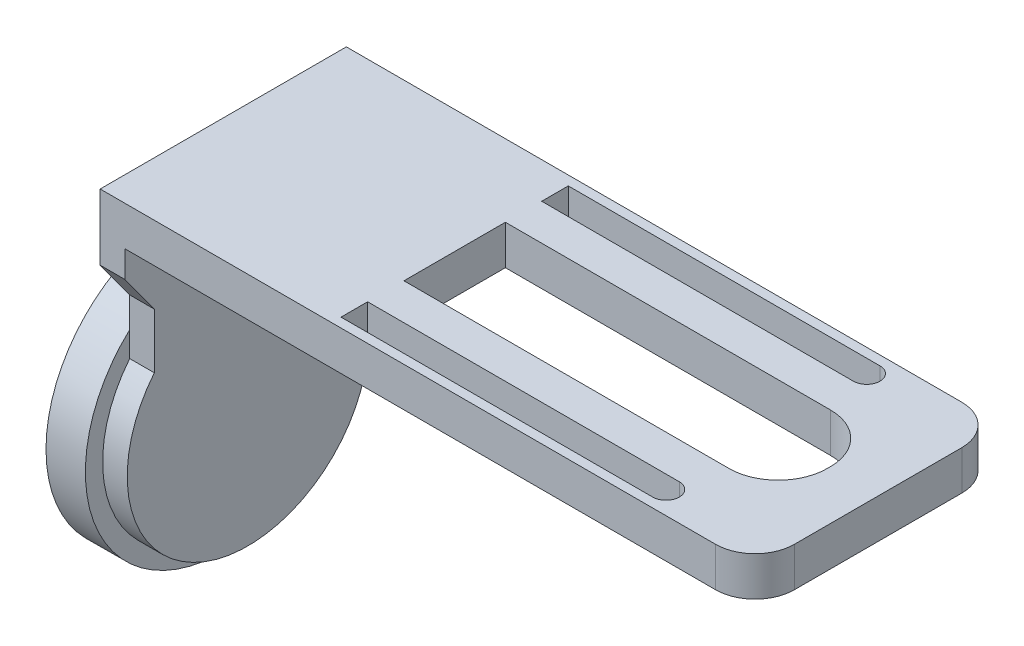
ISO-10303-21;
HEADER;
FILE_DESCRIPTION(('STEP AP214'),'2;1');
FILE_NAME('part.step','',(''),(''),'','','');
FILE_SCHEMA(('AUTOMOTIVE_DESIGN { 1 0 10303 214 1 1 1 1 }'));
ENDSEC;
DATA;
#1=APPLICATION_CONTEXT('core data for automotive mechanical design processes');
#2=APPLICATION_PROTOCOL_DEFINITION('international standard','automotive_design',2000,#1);
#3=PRODUCT_CONTEXT('',#1,'mechanical');
#4=PRODUCT('Part','Part','',(#3));
#5=PRODUCT_RELATED_PRODUCT_CATEGORY('part','',(#4));
#6=PRODUCT_DEFINITION_FORMATION('','',#4);
#7=PRODUCT_DEFINITION_CONTEXT('part definition',#1,'design');
#8=PRODUCT_DEFINITION('design','',#6,#7);
#9=PRODUCT_DEFINITION_SHAPE('','',#8);
#10=(LENGTH_UNIT() NAMED_UNIT(*) SI_UNIT(.MILLI.,.METRE.));
#11=(NAMED_UNIT(*) PLANE_ANGLE_UNIT() SI_UNIT($,.RADIAN.));
#12=(NAMED_UNIT(*) SI_UNIT($,.STERADIAN.) SOLID_ANGLE_UNIT());
#13=UNCERTAINTY_MEASURE_WITH_UNIT(LENGTH_MEASURE(1.E-05),#10,'distance_accuracy_value','');
#14=(GEOMETRIC_REPRESENTATION_CONTEXT(3) GLOBAL_UNCERTAINTY_ASSIGNED_CONTEXT((#13)) GLOBAL_UNIT_ASSIGNED_CONTEXT((#10,
#11,#12)) REPRESENTATION_CONTEXT('',''));
#15=CARTESIAN_POINT('',(0.,0.,0.));
#16=DIRECTION('',(0.,0.,1.));
#17=DIRECTION('',(1.,0.,0.));
#18=AXIS2_PLACEMENT_3D('',#15,#16,#17);
#19=CARTESIAN_POINT('',(62.5,4.,21.));
#20=DIRECTION('',(0.,1.,0.));
#21=DIRECTION('',(0.,0.,1.));
#22=AXIS2_PLACEMENT_3D('',#19,#20,#21);
#23=PLANE('',#22);
#24=DIRECTION('',(0.,0.,1.));
#25=VECTOR('',#24,1.);
#26=CARTESIAN_POINT('',(0.,4.,0.));
#27=LINE('',#26,#25);
#28=CARTESIAN_POINT('',(0.,4.,0.));
#29=VERTEX_POINT('',#28);
#30=CARTESIAN_POINT('',(0.,4.,25.));
#31=VERTEX_POINT('',#30);
#32=EDGE_CURVE('E441',#29,#31,#27,.T.);
#33=ORIENTED_EDGE('',*,*,#32,.T.);
#34=DIRECTION('',(1.,0.,0.));
#35=VECTOR('',#34,1.);
#36=CARTESIAN_POINT('',(0.,4.,25.));
#37=LINE('',#36,#35);
#38=CARTESIAN_POINT('',(62.5,4.,25.));
#39=VERTEX_POINT('',#38);
#40=EDGE_CURVE('E444',#31,#39,#37,.T.);
#41=ORIENTED_EDGE('',*,*,#40,.T.);
#42=CARTESIAN_POINT('',(62.5,4.,21.));
#43=DIRECTION('',(0.,1.,0.));
#44=DIRECTION('',(0.,0.,1.));
#45=AXIS2_PLACEMENT_3D('',#42,#43,#44);
#46=CIRCLE('',#45,4.);
#47=CARTESIAN_POINT('',(66.5,4.,21.));
#48=VERTEX_POINT('',#47);
#49=EDGE_CURVE('E447',#39,#48,#46,.T.);
#50=ORIENTED_EDGE('',*,*,#49,.T.);
#51=DIRECTION('',(0.,0.,-1.));
#52=VECTOR('',#51,1.);
#53=CARTESIAN_POINT('',(66.5,4.,4.00000000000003));
#54=LINE('',#53,#52);
#55=CARTESIAN_POINT('',(66.5,4.,4.00000000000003));
#56=VERTEX_POINT('',#55);
#57=EDGE_CURVE('E449',#48,#56,#54,.T.);
#58=ORIENTED_EDGE('',*,*,#57,.T.);
#59=CARTESIAN_POINT('',(62.5,4.,4.));
#60=DIRECTION('',(0.,1.,0.));
#61=DIRECTION('',(0.,0.,-1.));
#62=AXIS2_PLACEMENT_3D('',#59,#60,#61);
#63=CIRCLE('',#62,4.);
#64=CARTESIAN_POINT('',(62.5,4.,0.));
#65=VERTEX_POINT('',#64);
#66=EDGE_CURVE('E451',#56,#65,#63,.T.);
#67=ORIENTED_EDGE('',*,*,#66,.T.);
#68=DIRECTION('',(-1.,0.,0.));
#69=VECTOR('',#68,1.);
#70=CARTESIAN_POINT('',(0.,4.,0.));
#71=LINE('',#70,#69);
#72=EDGE_CURVE('E453',#65,#29,#71,.T.);
#73=ORIENTED_EDGE('',*,*,#72,.T.);
#74=EDGE_LOOP('',(#33,#41,#50,#58,#67,#73));
#75=FACE_BOUND('',#74,.T.);
#76=DIRECTION('',(1.,0.,0.));
#77=VECTOR('',#76,1.);
#78=CARTESIAN_POINT('',(23.5,4.,17.65));
#79=LINE('',#78,#77);
#80=CARTESIAN_POINT('',(23.5,4.,17.65));
#81=VERTEX_POINT('',#80);
#82=CARTESIAN_POINT('',(56.51,4.,17.65));
#83=VERTEX_POINT('',#82);
#84=EDGE_CURVE('E398',#81,#83,#79,.T.);
#85=ORIENTED_EDGE('',*,*,#84,.F.);
#86=DIRECTION('',(0.,0.,1.));
#87=VECTOR('',#86,1.);
#88=CARTESIAN_POINT('',(23.5,4.,7.35));
#89=LINE('',#88,#87);
#90=CARTESIAN_POINT('',(23.5,4.,7.35));
#91=VERTEX_POINT('',#90);
#92=EDGE_CURVE('E396',#91,#81,#89,.T.);
#93=ORIENTED_EDGE('',*,*,#92,.F.);
#94=DIRECTION('',(-1.,0.,0.));
#95=VECTOR('',#94,1.);
#96=CARTESIAN_POINT('',(23.5,4.,7.35));
#97=LINE('',#96,#95);
#98=CARTESIAN_POINT('',(56.51,4.,7.35));
#99=VERTEX_POINT('',#98);
#100=EDGE_CURVE('E408',#99,#91,#97,.T.);
#101=ORIENTED_EDGE('',*,*,#100,.F.);
#102=CARTESIAN_POINT('',(56.51,4.,12.34));
#103=DIRECTION('',(0.,1.,0.));
#104=DIRECTION('',(0.,0.,-1.));
#105=AXIS2_PLACEMENT_3D('',#102,#103,#104);
#106=CIRCLE('',#105,4.99);
#107=CARTESIAN_POINT('',(61.5,4.,12.34));
#108=VERTEX_POINT('',#107);
#109=EDGE_CURVE('E405',#108,#99,#106,.T.);
#110=ORIENTED_EDGE('',*,*,#109,.F.);
#111=DIRECTION('',(0.,0.,-1.));
#112=VECTOR('',#111,1.);
#113=CARTESIAN_POINT('',(61.5,4.,12.34));
#114=LINE('',#113,#112);
#115=CARTESIAN_POINT('',(61.5,4.,12.66));
#116=VERTEX_POINT('',#115);
#117=EDGE_CURVE('E403',#116,#108,#114,.T.);
#118=ORIENTED_EDGE('',*,*,#117,.F.);
#119=CARTESIAN_POINT('',(56.51,4.,12.66));
#120=DIRECTION('',(0.,1.,0.));
#121=DIRECTION('',(0.,0.,1.));
#122=AXIS2_PLACEMENT_3D('',#119,#120,#121);
#123=CIRCLE('',#122,4.99);
#124=EDGE_CURVE('E401',#83,#116,#123,.T.);
#125=ORIENTED_EDGE('',*,*,#124,.F.);
#126=EDGE_LOOP('',(#85,#93,#101,#110,#118,#125));
#127=FACE_BOUND('',#126,.T.);
#128=DIRECTION('',(1.,0.,0.));
#129=VECTOR('',#128,1.);
#130=CARTESIAN_POINT('',(23.5,4.,3.66));
#131=LINE('',#130,#129);
#132=CARTESIAN_POINT('',(23.5,4.,3.66));
#133=VERTEX_POINT('',#132);
#134=CARTESIAN_POINT('',(55.151,4.,3.66));
#135=VERTEX_POINT('',#134);
#136=EDGE_CURVE('E353',#133,#135,#131,.T.);
#137=ORIENTED_EDGE('',*,*,#136,.F.);
#138=DIRECTION('',(0.,0.,1.));
#139=VECTOR('',#138,1.);
#140=CARTESIAN_POINT('',(23.5,4.,0.960000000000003));
#141=LINE('',#140,#139);
#142=CARTESIAN_POINT('',(23.5,4.,0.960000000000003));
#143=VERTEX_POINT('',#142);
#144=EDGE_CURVE('E351',#143,#133,#141,.T.);
#145=ORIENTED_EDGE('',*,*,#144,.F.);
#146=DIRECTION('',(-1.,0.,0.));
#147=VECTOR('',#146,1.);
#148=CARTESIAN_POINT('',(23.5,4.,0.960000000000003));
#149=LINE('',#148,#147);
#150=CARTESIAN_POINT('',(55.151,4.,0.96));
#151=VERTEX_POINT('',#150);
#152=EDGE_CURVE('E363',#151,#143,#149,.T.);
#153=ORIENTED_EDGE('',*,*,#152,.F.);
#154=CARTESIAN_POINT('',(55.151,4.,2.309));
#155=DIRECTION('',(0.,1.,0.));
#156=DIRECTION('',(0.,0.,-1.));
#157=AXIS2_PLACEMENT_3D('',#154,#155,#156);
#158=CIRCLE('',#157,1.349);
#159=CARTESIAN_POINT('',(56.5,4.,2.309));
#160=VERTEX_POINT('',#159);
#161=EDGE_CURVE('E360',#160,#151,#158,.T.);
#162=ORIENTED_EDGE('',*,*,#161,.F.);
#163=DIRECTION('',(0.,0.,-1.));
#164=VECTOR('',#163,1.);
#165=CARTESIAN_POINT('',(56.5,4.,2.309));
#166=LINE('',#165,#164);
#167=CARTESIAN_POINT('',(56.5,4.,2.311));
#168=VERTEX_POINT('',#167);
#169=EDGE_CURVE('E358',#168,#160,#166,.T.);
#170=ORIENTED_EDGE('',*,*,#169,.F.);
#171=CARTESIAN_POINT('',(55.151,4.,2.311));
#172=DIRECTION('',(0.,1.,0.));
#173=DIRECTION('',(0.,0.,1.));
#174=AXIS2_PLACEMENT_3D('',#171,#172,#173);
#175=CIRCLE('',#174,1.349);
#176=EDGE_CURVE('E356',#135,#168,#175,.T.);
#177=ORIENTED_EDGE('',*,*,#176,.F.);
#178=EDGE_LOOP('',(#137,#145,#153,#162,#170,#177));
#179=FACE_BOUND('',#178,.T.);
#180=DIRECTION('',(1.,0.,0.));
#181=VECTOR('',#180,1.);
#182=CARTESIAN_POINT('',(23.5,4.,24.04));
#183=LINE('',#182,#181);
#184=CARTESIAN_POINT('',(23.5,4.,24.04));
#185=VERTEX_POINT('',#184);
#186=CARTESIAN_POINT('',(55.151,4.,24.04));
#187=VERTEX_POINT('',#186);
#188=EDGE_CURVE('E308',#185,#187,#183,.T.);
#189=ORIENTED_EDGE('',*,*,#188,.F.);
#190=DIRECTION('',(0.,0.,1.));
#191=VECTOR('',#190,1.);
#192=CARTESIAN_POINT('',(23.5,4.,24.04));
#193=LINE('',#192,#191);
#194=CARTESIAN_POINT('',(23.5,4.,21.34));
#195=VERTEX_POINT('',#194);
#196=EDGE_CURVE('E306',#195,#185,#193,.T.);
#197=ORIENTED_EDGE('',*,*,#196,.F.);
#198=DIRECTION('',(-1.,0.,0.));
#199=VECTOR('',#198,1.);
#200=CARTESIAN_POINT('',(23.5,4.,21.34));
#201=LINE('',#200,#199);
#202=CARTESIAN_POINT('',(55.151,4.,21.34));
#203=VERTEX_POINT('',#202);
#204=EDGE_CURVE('E318',#203,#195,#201,.T.);
#205=ORIENTED_EDGE('',*,*,#204,.F.);
#206=CARTESIAN_POINT('',(55.151,4.,22.689));
#207=DIRECTION('',(0.,1.,0.));
#208=DIRECTION('',(0.,0.,-1.));
#209=AXIS2_PLACEMENT_3D('',#206,#207,#208);
#210=CIRCLE('',#209,1.34900000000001);
#211=CARTESIAN_POINT('',(56.5,4.,22.689));
#212=VERTEX_POINT('',#211);
#213=EDGE_CURVE('E315',#212,#203,#210,.T.);
#214=ORIENTED_EDGE('',*,*,#213,.F.);
#215=DIRECTION('',(0.,0.,-1.));
#216=VECTOR('',#215,1.);
#217=CARTESIAN_POINT('',(56.5,4.,22.691));
#218=LINE('',#217,#216);
#219=CARTESIAN_POINT('',(56.5,4.,22.691));
#220=VERTEX_POINT('',#219);
#221=EDGE_CURVE('E313',#220,#212,#218,.T.);
#222=ORIENTED_EDGE('',*,*,#221,.F.);
#223=CARTESIAN_POINT('',(55.151,4.,22.691));
#224=DIRECTION('',(0.,1.,0.));
#225=DIRECTION('',(0.,0.,-1.));
#226=AXIS2_PLACEMENT_3D('',#223,#224,#225);
#227=CIRCLE('',#226,1.349);
#228=EDGE_CURVE('E311',#187,#220,#227,.T.);
#229=ORIENTED_EDGE('',*,*,#228,.F.);
#230=EDGE_LOOP('',(#189,#197,#205,#214,#222,#229));
#231=FACE_BOUND('',#230,.T.);
#232=ADVANCED_FACE('F33',(#75,#127,#179,#231),#23,.T.);
#233=CARTESIAN_POINT('',(62.5,0.,21.));
#234=DIRECTION('',(0.,1.,0.));
#235=DIRECTION('',(0.,0.,1.));
#236=AXIS2_PLACEMENT_3D('',#233,#234,#235);
#237=PLANE('',#236);
#238=DIRECTION('',(0.,0.,1.));
#239=VECTOR('',#238,1.);
#240=CARTESIAN_POINT('',(23.5,0.,0.960000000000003));
#241=LINE('',#240,#239);
#242=CARTESIAN_POINT('',(23.5,0.,0.960000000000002));
#243=VERTEX_POINT('',#242);
#244=CARTESIAN_POINT('',(23.5,0.,3.66));
#245=VERTEX_POINT('',#244);
#246=EDGE_CURVE('E350',#243,#245,#241,.T.);
#247=ORIENTED_EDGE('',*,*,#246,.T.);
#248=DIRECTION('',(1.,0.,0.));
#249=VECTOR('',#248,1.);
#250=CARTESIAN_POINT('',(23.5,0.,3.66));
#251=LINE('',#250,#249);
#252=CARTESIAN_POINT('',(55.151,0.,3.66));
#253=VERTEX_POINT('',#252);
#254=EDGE_CURVE('E368',#245,#253,#251,.T.);
#255=ORIENTED_EDGE('',*,*,#254,.T.);
#256=CARTESIAN_POINT('',(55.151,0.,2.311));
#257=DIRECTION('',(0.,1.,0.));
#258=DIRECTION('',(0.,0.,1.));
#259=AXIS2_PLACEMENT_3D('',#256,#257,#258);
#260=CIRCLE('',#259,1.349);
#261=CARTESIAN_POINT('',(56.5,0.,2.311));
#262=VERTEX_POINT('',#261);
#263=EDGE_CURVE('E371',#253,#262,#260,.T.);
#264=ORIENTED_EDGE('',*,*,#263,.T.);
#265=DIRECTION('',(0.,0.,-1.));
#266=VECTOR('',#265,1.);
#267=CARTESIAN_POINT('',(56.5,0.,2.309));
#268=LINE('',#267,#266);
#269=CARTESIAN_POINT('',(56.5,0.,2.309));
#270=VERTEX_POINT('',#269);
#271=EDGE_CURVE('E374',#262,#270,#268,.T.);
#272=ORIENTED_EDGE('',*,*,#271,.T.);
#273=CARTESIAN_POINT('',(55.151,0.,2.309));
#274=DIRECTION('',(0.,1.,0.));
#275=DIRECTION('',(0.,0.,-1.));
#276=AXIS2_PLACEMENT_3D('',#273,#274,#275);
#277=CIRCLE('',#276,1.349);
#278=CARTESIAN_POINT('',(55.151,0.,0.96));
#279=VERTEX_POINT('',#278);
#280=EDGE_CURVE('E377',#270,#279,#277,.T.);
#281=ORIENTED_EDGE('',*,*,#280,.T.);
#282=DIRECTION('',(-1.,0.,0.));
#283=VECTOR('',#282,1.);
#284=CARTESIAN_POINT('',(23.5,0.,0.960000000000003));
#285=LINE('',#284,#283);
#286=EDGE_CURVE('E354',#279,#243,#285,.T.);
#287=ORIENTED_EDGE('',*,*,#286,.T.);
#288=EDGE_LOOP('',(#247,#255,#264,#272,#281,#287));
#289=FACE_BOUND('',#288,.T.);
#290=DIRECTION('',(1.,0.,0.));
#291=VECTOR('',#290,1.);
#292=CARTESIAN_POINT('',(0.,0.,25.));
#293=LINE('',#292,#291);
#294=CARTESIAN_POINT('',(2.5,0.,25.));
#295=VERTEX_POINT('',#294);
#296=CARTESIAN_POINT('',(62.5,0.,25.));
#297=VERTEX_POINT('',#296);
#298=EDGE_CURVE('E440',#295,#297,#293,.T.);
#299=ORIENTED_EDGE('',*,*,#298,.F.);
#300=DIRECTION('',(0.,0.,-1.));
#301=VECTOR('',#300,1.);
#302=CARTESIAN_POINT('',(2.5,0.,25.));
#303=LINE('',#302,#301);
#304=CARTESIAN_POINT('',(2.5,0.,0.));
#305=VERTEX_POINT('',#304);
#306=EDGE_CURVE('E267',#295,#305,#303,.T.);
#307=ORIENTED_EDGE('',*,*,#306,.T.);
#308=DIRECTION('',(-1.,0.,0.));
#309=VECTOR('',#308,1.);
#310=CARTESIAN_POINT('',(0.,0.,0.));
#311=LINE('',#310,#309);
#312=CARTESIAN_POINT('',(62.5,0.,0.));
#313=VERTEX_POINT('',#312);
#314=EDGE_CURVE('E445',#313,#305,#311,.T.);
#315=ORIENTED_EDGE('',*,*,#314,.F.);
#316=CARTESIAN_POINT('',(62.5,0.,4.));
#317=DIRECTION('',(0.,1.,0.));
#318=DIRECTION('',(0.,0.,-1.));
#319=AXIS2_PLACEMENT_3D('',#316,#317,#318);
#320=CIRCLE('',#319,4.);
#321=CARTESIAN_POINT('',(66.5,0.,4.00000000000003));
#322=VERTEX_POINT('',#321);
#323=EDGE_CURVE('E461',#322,#313,#320,.T.);
#324=ORIENTED_EDGE('',*,*,#323,.F.);
#325=DIRECTION('',(0.,0.,-1.));
#326=VECTOR('',#325,1.);
#327=CARTESIAN_POINT('',(66.5,0.,4.00000000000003));
#328=LINE('',#327,#326);
#329=CARTESIAN_POINT('',(66.5,0.,21.));
#330=VERTEX_POINT('',#329);
#331=EDGE_CURVE('E459',#330,#322,#328,.T.);
#332=ORIENTED_EDGE('',*,*,#331,.F.);
#333=CARTESIAN_POINT('',(62.5,0.,21.));
#334=DIRECTION('',(0.,1.,0.));
#335=DIRECTION('',(0.,0.,1.));
#336=AXIS2_PLACEMENT_3D('',#333,#334,#335);
#337=CIRCLE('',#336,4.);
#338=EDGE_CURVE('E457',#297,#330,#337,.T.);
#339=ORIENTED_EDGE('',*,*,#338,.F.);
#340=EDGE_LOOP('',(#299,#307,#315,#324,#332,#339));
#341=FACE_BOUND('',#340,.T.);
#342=DIRECTION('',(0.,0.,1.));
#343=VECTOR('',#342,1.);
#344=CARTESIAN_POINT('',(23.5,0.,7.35));
#345=LINE('',#344,#343);
#346=CARTESIAN_POINT('',(23.5,0.,7.35));
#347=VERTEX_POINT('',#346);
#348=CARTESIAN_POINT('',(23.5,0.,17.65));
#349=VERTEX_POINT('',#348);
#350=EDGE_CURVE('E395',#347,#349,#345,.T.);
#351=ORIENTED_EDGE('',*,*,#350,.T.);
#352=DIRECTION('',(1.,0.,0.));
#353=VECTOR('',#352,1.);
#354=CARTESIAN_POINT('',(23.5,0.,17.65));
#355=LINE('',#354,#353);
#356=CARTESIAN_POINT('',(56.51,0.,17.65));
#357=VERTEX_POINT('',#356);
#358=EDGE_CURVE('E413',#349,#357,#355,.T.);
#359=ORIENTED_EDGE('',*,*,#358,.T.);
#360=CARTESIAN_POINT('',(56.51,0.,12.66));
#361=DIRECTION('',(0.,1.,0.));
#362=DIRECTION('',(0.,0.,1.));
#363=AXIS2_PLACEMENT_3D('',#360,#361,#362);
#364=CIRCLE('',#363,4.99);
#365=CARTESIAN_POINT('',(61.5,0.,12.66));
#366=VERTEX_POINT('',#365);
#367=EDGE_CURVE('E416',#357,#366,#364,.T.);
#368=ORIENTED_EDGE('',*,*,#367,.T.);
#369=DIRECTION('',(0.,0.,-1.));
#370=VECTOR('',#369,1.);
#371=CARTESIAN_POINT('',(61.5,0.,12.34));
#372=LINE('',#371,#370);
#373=CARTESIAN_POINT('',(61.5,0.,12.34));
#374=VERTEX_POINT('',#373);
#375=EDGE_CURVE('E419',#366,#374,#372,.T.);
#376=ORIENTED_EDGE('',*,*,#375,.T.);
#377=CARTESIAN_POINT('',(56.51,0.,12.34));
#378=DIRECTION('',(0.,1.,0.));
#379=DIRECTION('',(0.,0.,-1.));
#380=AXIS2_PLACEMENT_3D('',#377,#378,#379);
#381=CIRCLE('',#380,4.99);
#382=CARTESIAN_POINT('',(56.51,0.,7.35));
#383=VERTEX_POINT('',#382);
#384=EDGE_CURVE('E422',#374,#383,#381,.T.);
#385=ORIENTED_EDGE('',*,*,#384,.T.);
#386=DIRECTION('',(-1.,0.,0.));
#387=VECTOR('',#386,1.);
#388=CARTESIAN_POINT('',(23.5,0.,7.35));
#389=LINE('',#388,#387);
#390=EDGE_CURVE('E399',#383,#347,#389,.T.);
#391=ORIENTED_EDGE('',*,*,#390,.T.);
#392=EDGE_LOOP('',(#351,#359,#368,#376,#385,#391));
#393=FACE_BOUND('',#392,.T.);
#394=DIRECTION('',(0.,0.,1.));
#395=VECTOR('',#394,1.);
#396=CARTESIAN_POINT('',(23.5,0.,24.04));
#397=LINE('',#396,#395);
#398=CARTESIAN_POINT('',(23.5,0.,21.34));
#399=VERTEX_POINT('',#398);
#400=CARTESIAN_POINT('',(23.5,0.,24.04));
#401=VERTEX_POINT('',#400);
#402=EDGE_CURVE('E295',#399,#401,#397,.T.);
#403=ORIENTED_EDGE('',*,*,#402,.T.);
#404=DIRECTION('',(1.,0.,0.));
#405=VECTOR('',#404,1.);
#406=CARTESIAN_POINT('',(23.5,0.,24.04));
#407=LINE('',#406,#405);
#408=CARTESIAN_POINT('',(55.151,0.,24.04));
#409=VERTEX_POINT('',#408);
#410=EDGE_CURVE('E323',#401,#409,#407,.T.);
#411=ORIENTED_EDGE('',*,*,#410,.T.);
#412=CARTESIAN_POINT('',(55.151,0.,22.691));
#413=DIRECTION('',(0.,1.,0.));
#414=DIRECTION('',(0.,0.,-1.));
#415=AXIS2_PLACEMENT_3D('',#412,#413,#414);
#416=CIRCLE('',#415,1.349);
#417=CARTESIAN_POINT('',(56.5,0.,22.691));
#418=VERTEX_POINT('',#417);
#419=EDGE_CURVE('E326',#409,#418,#416,.T.);
#420=ORIENTED_EDGE('',*,*,#419,.T.);
#421=DIRECTION('',(0.,0.,-1.));
#422=VECTOR('',#421,1.);
#423=CARTESIAN_POINT('',(56.5,0.,22.691));
#424=LINE('',#423,#422);
#425=CARTESIAN_POINT('',(56.5,0.,22.689));
#426=VERTEX_POINT('',#425);
#427=EDGE_CURVE('E329',#418,#426,#424,.T.);
#428=ORIENTED_EDGE('',*,*,#427,.T.);
#429=CARTESIAN_POINT('',(55.151,0.,22.689));
#430=DIRECTION('',(0.,1.,0.));
#431=DIRECTION('',(0.,0.,-1.));
#432=AXIS2_PLACEMENT_3D('',#429,#430,#431);
#433=CIRCLE('',#432,1.34900000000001);
#434=CARTESIAN_POINT('',(55.151,0.,21.34));
#435=VERTEX_POINT('',#434);
#436=EDGE_CURVE('E332',#426,#435,#433,.T.);
#437=ORIENTED_EDGE('',*,*,#436,.T.);
#438=DIRECTION('',(-1.,0.,0.));
#439=VECTOR('',#438,1.);
#440=CARTESIAN_POINT('',(23.5,0.,21.34));
#441=LINE('',#440,#439);
#442=EDGE_CURVE('E309',#435,#399,#441,.T.);
#443=ORIENTED_EDGE('',*,*,#442,.T.);
#444=EDGE_LOOP('',(#403,#411,#420,#428,#437,#443));
#445=FACE_BOUND('',#444,.T.);
#446=ADVANCED_FACE('F485',(#289,#341,#393,#445),#237,.F.);
#447=CARTESIAN_POINT('',(0.,4.,0.));
#448=DIRECTION('',(1.,0.,0.));
#449=DIRECTION('',(0.,0.,-1.));
#450=AXIS2_PLACEMENT_3D('',#447,#448,#449);
#451=PLANE('',#450);
#452=CARTESIAN_POINT('',(0.,-20.15,12.5));
#453=DIRECTION('',(-1.,0.,0.));
#454=DIRECTION('',(0.,0.,1.));
#455=AXIS2_PLACEMENT_3D('',#452,#453,#454);
#456=CIRCLE('',#455,14.);
#457=CARTESIAN_POINT('',(0.,-9.86651809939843,22.));
#458=VERTEX_POINT('',#457);
#459=CARTESIAN_POINT('',(0.,-9.86651809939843,3.));
#460=VERTEX_POINT('',#459);
#461=EDGE_CURVE('E48',#458,#460,#456,.T.);
#462=ORIENTED_EDGE('',*,*,#461,.F.);
#463=DIRECTION('',(0.,1.,0.));
#464=VECTOR('',#463,1.);
#465=CARTESIAN_POINT('',(0.,-6.81614585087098,22.));
#466=LINE('',#465,#464);
#467=CARTESIAN_POINT('',(0.,-6.81614585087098,22.));
#468=VERTEX_POINT('',#467);
#469=EDGE_CURVE('E288',#458,#468,#466,.T.);
#470=ORIENTED_EDGE('',*,*,#469,.T.);
#471=DIRECTION('',(0.,0.808134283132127,0.58899828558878));
#472=VECTOR('',#471,1.);
#473=CARTESIAN_POINT('',(0.,-2.7,25.));
#474=LINE('',#473,#472);
#475=CARTESIAN_POINT('',(0.,-2.7,25.));
#476=VERTEX_POINT('',#475);
#477=EDGE_CURVE('E268',#468,#476,#474,.T.);
#478=ORIENTED_EDGE('',*,*,#477,.T.);
#479=DIRECTION('',(0.,-1.,0.));
#480=VECTOR('',#479,1.);
#481=CARTESIAN_POINT('',(0.,4.,25.));
#482=LINE('',#481,#480);
#483=EDGE_CURVE('E11',#31,#476,#482,.T.);
#484=ORIENTED_EDGE('',*,*,#483,.F.);
#485=ORIENTED_EDGE('',*,*,#32,.F.);
#486=DIRECTION('',(0.,-1.,0.));
#487=VECTOR('',#486,1.);
#488=CARTESIAN_POINT('',(0.,4.,0.));
#489=LINE('',#488,#487);
#490=CARTESIAN_POINT('',(0.,-2.7,0.));
#491=VERTEX_POINT('',#490);
#492=EDGE_CURVE('E455',#29,#491,#489,.T.);
#493=ORIENTED_EDGE('',*,*,#492,.T.);
#494=DIRECTION('',(0.,-0.808134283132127,0.588998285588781));
#495=VECTOR('',#494,1.);
#496=CARTESIAN_POINT('',(0.,-2.7,0.));
#497=LINE('',#496,#495);
#498=CARTESIAN_POINT('',(0.,-6.81614585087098,3.));
#499=VERTEX_POINT('',#498);
#500=EDGE_CURVE('E238',#491,#499,#497,.T.);
#501=ORIENTED_EDGE('',*,*,#500,.T.);
#502=DIRECTION('',(0.,-1.,0.));
#503=VECTOR('',#502,1.);
#504=CARTESIAN_POINT('',(0.,-6.81614585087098,3.));
#505=LINE('',#504,#503);
#506=EDGE_CURVE('E235',#499,#460,#505,.T.);
#507=ORIENTED_EDGE('',*,*,#506,.T.);
#508=EDGE_LOOP('',(#462,#470,#478,#484,#485,#493,#501,#507));
#509=FACE_BOUND('',#508,.T.);
#510=ADVANCED_FACE('F35',(#509),#451,.F.);
#511=CARTESIAN_POINT('',(0.,4.,25.));
#512=DIRECTION('',(0.,0.,-1.));
#513=DIRECTION('',(-1.,0.,0.));
#514=AXIS2_PLACEMENT_3D('',#511,#512,#513);
#515=PLANE('',#514);
#516=ORIENTED_EDGE('',*,*,#483,.T.);
#517=DIRECTION('',(-1.,0.,0.));
#518=VECTOR('',#517,1.);
#519=CARTESIAN_POINT('',(2.5,-2.7,25.));
#520=LINE('',#519,#518);
#521=CARTESIAN_POINT('',(2.5,-2.7,25.));
#522=VERTEX_POINT('',#521);
#523=EDGE_CURVE('E292',#522,#476,#520,.T.);
#524=ORIENTED_EDGE('',*,*,#523,.F.);
#525=DIRECTION('',(0.,1.,0.));
#526=VECTOR('',#525,1.);
#527=CARTESIAN_POINT('',(2.5,0.,25.));
#528=LINE('',#527,#526);
#529=EDGE_CURVE('E264',#522,#295,#528,.T.);
#530=ORIENTED_EDGE('',*,*,#529,.T.);
#531=ORIENTED_EDGE('',*,*,#298,.T.);
#532=DIRECTION('',(0.,-1.,0.));
#533=VECTOR('',#532,1.);
#534=CARTESIAN_POINT('',(62.5,4.,25.));
#535=LINE('',#534,#533);
#536=EDGE_CURVE('E41',#39,#297,#535,.T.);
#537=ORIENTED_EDGE('',*,*,#536,.F.);
#538=ORIENTED_EDGE('',*,*,#40,.F.);
#539=EDGE_LOOP('',(#516,#524,#530,#531,#537,#538));
#540=FACE_BOUND('',#539,.T.);
#541=ADVANCED_FACE('F503',(#540),#515,.F.);
#542=CARTESIAN_POINT('',(62.5,4.,21.));
#543=DIRECTION('',(0.,-1.,0.));
#544=DIRECTION('',(0.,0.,-1.));
#545=AXIS2_PLACEMENT_3D('',#542,#543,#544);
#546=CYLINDRICAL_SURFACE('',#545,4.);
#547=ORIENTED_EDGE('',*,*,#338,.T.);
#548=DIRECTION('',(0.,-1.,0.));
#549=VECTOR('',#548,1.);
#550=CARTESIAN_POINT('',(66.5,4.,21.));
#551=LINE('',#550,#549);
#552=EDGE_CURVE('E472',#48,#330,#551,.T.);
#553=ORIENTED_EDGE('',*,*,#552,.F.);
#554=ORIENTED_EDGE('',*,*,#49,.F.);
#555=ORIENTED_EDGE('',*,*,#536,.T.);
#556=EDGE_LOOP('',(#547,#553,#554,#555));
#557=FACE_BOUND('',#556,.T.);
#558=ADVANCED_FACE('F479',(#557),#546,.T.);
#559=CARTESIAN_POINT('',(66.5,4.,4.00000000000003));
#560=DIRECTION('',(-1.,0.,0.));
#561=DIRECTION('',(0.,0.,1.));
#562=AXIS2_PLACEMENT_3D('',#559,#560,#561);
#563=PLANE('',#562);
#564=ORIENTED_EDGE('',*,*,#331,.T.);
#565=DIRECTION('',(0.,-1.,0.));
#566=VECTOR('',#565,1.);
#567=CARTESIAN_POINT('',(66.5,4.,4.00000000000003));
#568=LINE('',#567,#566);
#569=EDGE_CURVE('E469',#56,#322,#568,.T.);
#570=ORIENTED_EDGE('',*,*,#569,.F.);
#571=ORIENTED_EDGE('',*,*,#57,.F.);
#572=ORIENTED_EDGE('',*,*,#552,.T.);
#573=EDGE_LOOP('',(#564,#570,#571,#572));
#574=FACE_BOUND('',#573,.T.);
#575=ADVANCED_FACE('F491',(#574),#563,.F.);
#576=CARTESIAN_POINT('',(62.5,4.,4.));
#577=DIRECTION('',(0.,-1.,0.));
#578=DIRECTION('',(0.,0.,-1.));
#579=AXIS2_PLACEMENT_3D('',#576,#577,#578);
#580=CYLINDRICAL_SURFACE('',#579,4.);
#581=ORIENTED_EDGE('',*,*,#323,.T.);
#582=DIRECTION('',(0.,-1.,0.));
#583=VECTOR('',#582,1.);
#584=CARTESIAN_POINT('',(62.5,4.,0.));
#585=LINE('',#584,#583);
#586=EDGE_CURVE('E466',#65,#313,#585,.T.);
#587=ORIENTED_EDGE('',*,*,#586,.F.);
#588=ORIENTED_EDGE('',*,*,#66,.F.);
#589=ORIENTED_EDGE('',*,*,#569,.T.);
#590=EDGE_LOOP('',(#581,#587,#588,#589));
#591=FACE_BOUND('',#590,.T.);
#592=ADVANCED_FACE('F495',(#591),#580,.T.);
#593=CARTESIAN_POINT('',(0.,4.,0.));
#594=DIRECTION('',(0.,0.,1.));
#595=DIRECTION('',(1.,0.,0.));
#596=AXIS2_PLACEMENT_3D('',#593,#594,#595);
#597=PLANE('',#596);
#598=ORIENTED_EDGE('',*,*,#314,.T.);
#599=DIRECTION('',(0.,-1.,0.));
#600=VECTOR('',#599,1.);
#601=CARTESIAN_POINT('',(2.5,0.,0.));
#602=LINE('',#601,#600);
#603=CARTESIAN_POINT('',(2.5,-2.7,0.));
#604=VERTEX_POINT('',#603);
#605=EDGE_CURVE('E56',#305,#604,#602,.T.);
#606=ORIENTED_EDGE('',*,*,#605,.T.);
#607=DIRECTION('',(-1.,0.,0.));
#608=VECTOR('',#607,1.);
#609=CARTESIAN_POINT('',(2.5,-2.7,0.));
#610=LINE('',#609,#608);
#611=EDGE_CURVE('E285',#604,#491,#610,.T.);
#612=ORIENTED_EDGE('',*,*,#611,.T.);
#613=ORIENTED_EDGE('',*,*,#492,.F.);
#614=ORIENTED_EDGE('',*,*,#72,.F.);
#615=ORIENTED_EDGE('',*,*,#586,.T.);
#616=EDGE_LOOP('',(#598,#606,#612,#613,#614,#615));
#617=FACE_BOUND('',#616,.T.);
#618=ADVANCED_FACE('F515',(#617),#597,.F.);
#619=CARTESIAN_POINT('',(23.5,4.,7.35));
#620=DIRECTION('',(1.,0.,0.));
#621=DIRECTION('',(0.,0.,-1.));
#622=AXIS2_PLACEMENT_3D('',#619,#620,#621);
#623=PLANE('',#622);
#624=ORIENTED_EDGE('',*,*,#350,.F.);
#625=DIRECTION('',(0.,-1.,0.));
#626=VECTOR('',#625,1.);
#627=CARTESIAN_POINT('',(23.5,4.,7.35));
#628=LINE('',#627,#626);
#629=EDGE_CURVE('E410',#91,#347,#628,.T.);
#630=ORIENTED_EDGE('',*,*,#629,.F.);
#631=ORIENTED_EDGE('',*,*,#92,.T.);
#632=DIRECTION('',(0.,-1.,0.));
#633=VECTOR('',#632,1.);
#634=CARTESIAN_POINT('',(23.5,4.,17.65));
#635=LINE('',#634,#633);
#636=EDGE_CURVE('E437',#81,#349,#635,.T.);
#637=ORIENTED_EDGE('',*,*,#636,.T.);
#638=EDGE_LOOP('',(#624,#630,#631,#637));
#639=FACE_BOUND('',#638,.T.);
#640=ADVANCED_FACE('F537',(#639),#623,.T.);
#641=CARTESIAN_POINT('',(23.5,4.,17.65));
#642=DIRECTION('',(0.,0.,-1.));
#643=DIRECTION('',(-1.,0.,0.));
#644=AXIS2_PLACEMENT_3D('',#641,#642,#643);
#645=PLANE('',#644);
#646=ORIENTED_EDGE('',*,*,#358,.F.);
#647=ORIENTED_EDGE('',*,*,#636,.F.);
#648=ORIENTED_EDGE('',*,*,#84,.T.);
#649=DIRECTION('',(0.,-1.,0.));
#650=VECTOR('',#649,1.);
#651=CARTESIAN_POINT('',(56.51,4.,17.65));
#652=LINE('',#651,#650);
#653=EDGE_CURVE('E435',#83,#357,#652,.T.);
#654=ORIENTED_EDGE('',*,*,#653,.T.);
#655=EDGE_LOOP('',(#646,#647,#648,#654));
#656=FACE_BOUND('',#655,.T.);
#657=ADVANCED_FACE('F711',(#656),#645,.T.);
#658=CARTESIAN_POINT('',(56.51,4.,12.66));
#659=DIRECTION('',(0.,-1.,0.));
#660=DIRECTION('',(0.,0.,-1.));
#661=AXIS2_PLACEMENT_3D('',#658,#659,#660);
#662=CYLINDRICAL_SURFACE('',#661,4.99);
#663=ORIENTED_EDGE('',*,*,#367,.F.);
#664=ORIENTED_EDGE('',*,*,#653,.F.);
#665=ORIENTED_EDGE('',*,*,#124,.T.);
#666=DIRECTION('',(0.,-1.,0.));
#667=VECTOR('',#666,1.);
#668=CARTESIAN_POINT('',(61.5,4.,12.66));
#669=LINE('',#668,#667);
#670=EDGE_CURVE('E433',#116,#366,#669,.T.);
#671=ORIENTED_EDGE('',*,*,#670,.T.);
#672=EDGE_LOOP('',(#663,#664,#665,#671));
#673=FACE_BOUND('',#672,.T.);
#674=ADVANCED_FACE('F708',(#673),#662,.F.);
#675=CARTESIAN_POINT('',(61.5,4.,12.34));
#676=DIRECTION('',(-1.,0.,0.));
#677=DIRECTION('',(0.,0.,1.));
#678=AXIS2_PLACEMENT_3D('',#675,#676,#677);
#679=PLANE('',#678);
#680=ORIENTED_EDGE('',*,*,#375,.F.);
#681=ORIENTED_EDGE('',*,*,#670,.F.);
#682=ORIENTED_EDGE('',*,*,#117,.T.);
#683=DIRECTION('',(0.,-1.,0.));
#684=VECTOR('',#683,1.);
#685=CARTESIAN_POINT('',(61.5,4.,12.34));
#686=LINE('',#685,#684);
#687=EDGE_CURVE('E431',#108,#374,#686,.T.);
#688=ORIENTED_EDGE('',*,*,#687,.T.);
#689=EDGE_LOOP('',(#680,#681,#682,#688));
#690=FACE_BOUND('',#689,.T.);
#691=ADVANCED_FACE('F704',(#690),#679,.T.);
#692=CARTESIAN_POINT('',(56.51,4.,12.34));
#693=DIRECTION('',(0.,-1.,0.));
#694=DIRECTION('',(0.,0.,-1.));
#695=AXIS2_PLACEMENT_3D('',#692,#693,#694);
#696=CYLINDRICAL_SURFACE('',#695,4.99);
#697=ORIENTED_EDGE('',*,*,#384,.F.);
#698=ORIENTED_EDGE('',*,*,#687,.F.);
#699=ORIENTED_EDGE('',*,*,#109,.T.);
#700=DIRECTION('',(0.,-1.,0.));
#701=VECTOR('',#700,1.);
#702=CARTESIAN_POINT('',(56.51,4.,7.35));
#703=LINE('',#702,#701);
#704=EDGE_CURVE('E429',#99,#383,#703,.T.);
#705=ORIENTED_EDGE('',*,*,#704,.T.);
#706=EDGE_LOOP('',(#697,#698,#699,#705));
#707=FACE_BOUND('',#706,.T.);
#708=ADVANCED_FACE('F700',(#707),#696,.F.);
#709=CARTESIAN_POINT('',(23.5,4.,7.35));
#710=DIRECTION('',(0.,0.,1.));
#711=DIRECTION('',(1.,0.,0.));
#712=AXIS2_PLACEMENT_3D('',#709,#710,#711);
#713=PLANE('',#712);
#714=ORIENTED_EDGE('',*,*,#390,.F.);
#715=ORIENTED_EDGE('',*,*,#704,.F.);
#716=ORIENTED_EDGE('',*,*,#100,.T.);
#717=ORIENTED_EDGE('',*,*,#629,.T.);
#718=EDGE_LOOP('',(#714,#715,#716,#717));
#719=FACE_BOUND('',#718,.T.);
#720=ADVANCED_FACE('F696',(#719),#713,.T.);
#721=CARTESIAN_POINT('',(23.5,4.,0.960000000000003));
#722=DIRECTION('',(1.,0.,0.));
#723=DIRECTION('',(0.,0.,-1.));
#724=AXIS2_PLACEMENT_3D('',#721,#722,#723);
#725=PLANE('',#724);
#726=ORIENTED_EDGE('',*,*,#246,.F.);
#727=DIRECTION('',(0.,-1.,0.));
#728=VECTOR('',#727,1.);
#729=CARTESIAN_POINT('',(23.5,4.,0.960000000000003));
#730=LINE('',#729,#728);
#731=EDGE_CURVE('E365',#143,#243,#730,.T.);
#732=ORIENTED_EDGE('',*,*,#731,.F.);
#733=ORIENTED_EDGE('',*,*,#144,.T.);
#734=DIRECTION('',(0.,-1.,0.));
#735=VECTOR('',#734,1.);
#736=CARTESIAN_POINT('',(23.5,4.,3.66));
#737=LINE('',#736,#735);
#738=EDGE_CURVE('E392',#133,#245,#737,.T.);
#739=ORIENTED_EDGE('',*,*,#738,.T.);
#740=EDGE_LOOP('',(#726,#732,#733,#739));
#741=FACE_BOUND('',#740,.T.);
#742=ADVANCED_FACE('F692',(#741),#725,.T.);
#743=CARTESIAN_POINT('',(23.5,4.,3.66));
#744=DIRECTION('',(0.,0.,-1.));
#745=DIRECTION('',(-1.,0.,0.));
#746=AXIS2_PLACEMENT_3D('',#743,#744,#745);
#747=PLANE('',#746);
#748=ORIENTED_EDGE('',*,*,#254,.F.);
#749=ORIENTED_EDGE('',*,*,#738,.F.);
#750=ORIENTED_EDGE('',*,*,#136,.T.);
#751=DIRECTION('',(0.,-1.,0.));
#752=VECTOR('',#751,1.);
#753=CARTESIAN_POINT('',(55.151,4.,3.66));
#754=LINE('',#753,#752);
#755=EDGE_CURVE('E390',#135,#253,#754,.T.);
#756=ORIENTED_EDGE('',*,*,#755,.T.);
#757=EDGE_LOOP('',(#748,#749,#750,#756));
#758=FACE_BOUND('',#757,.T.);
#759=ADVANCED_FACE('F688',(#758),#747,.T.);
#760=CARTESIAN_POINT('',(55.151,4.,2.311));
#761=DIRECTION('',(0.,-1.,0.));
#762=DIRECTION('',(0.,0.,-1.));
#763=AXIS2_PLACEMENT_3D('',#760,#761,#762);
#764=CYLINDRICAL_SURFACE('',#763,1.349);
#765=ORIENTED_EDGE('',*,*,#263,.F.);
#766=ORIENTED_EDGE('',*,*,#755,.F.);
#767=ORIENTED_EDGE('',*,*,#176,.T.);
#768=DIRECTION('',(0.,-1.,0.));
#769=VECTOR('',#768,1.);
#770=CARTESIAN_POINT('',(56.5,4.,2.311));
#771=LINE('',#770,#769);
#772=EDGE_CURVE('E388',#168,#262,#771,.T.);
#773=ORIENTED_EDGE('',*,*,#772,.T.);
#774=EDGE_LOOP('',(#765,#766,#767,#773));
#775=FACE_BOUND('',#774,.T.);
#776=ADVANCED_FACE('F684',(#775),#764,.F.);
#777=CARTESIAN_POINT('',(56.5,4.,2.309));
#778=DIRECTION('',(-1.,0.,0.));
#779=DIRECTION('',(0.,0.,1.));
#780=AXIS2_PLACEMENT_3D('',#777,#778,#779);
#781=PLANE('',#780);
#782=ORIENTED_EDGE('',*,*,#271,.F.);
#783=ORIENTED_EDGE('',*,*,#772,.F.);
#784=ORIENTED_EDGE('',*,*,#169,.T.);
#785=DIRECTION('',(0.,-1.,0.));
#786=VECTOR('',#785,1.);
#787=CARTESIAN_POINT('',(56.5,4.,2.309));
#788=LINE('',#787,#786);
#789=EDGE_CURVE('E386',#160,#270,#788,.T.);
#790=ORIENTED_EDGE('',*,*,#789,.T.);
#791=EDGE_LOOP('',(#782,#783,#784,#790));
#792=FACE_BOUND('',#791,.T.);
#793=ADVANCED_FACE('F680',(#792),#781,.T.);
#794=CARTESIAN_POINT('',(55.151,4.,2.309));
#795=DIRECTION('',(0.,-1.,0.));
#796=DIRECTION('',(0.,0.,-1.));
#797=AXIS2_PLACEMENT_3D('',#794,#795,#796);
#798=CYLINDRICAL_SURFACE('',#797,1.349);
#799=ORIENTED_EDGE('',*,*,#280,.F.);
#800=ORIENTED_EDGE('',*,*,#789,.F.);
#801=ORIENTED_EDGE('',*,*,#161,.T.);
#802=DIRECTION('',(0.,-1.,0.));
#803=VECTOR('',#802,1.);
#804=CARTESIAN_POINT('',(55.151,4.,0.96));
#805=LINE('',#804,#803);
#806=EDGE_CURVE('E384',#151,#279,#805,.T.);
#807=ORIENTED_EDGE('',*,*,#806,.T.);
#808=EDGE_LOOP('',(#799,#800,#801,#807));
#809=FACE_BOUND('',#808,.T.);
#810=ADVANCED_FACE('F676',(#809),#798,.F.);
#811=CARTESIAN_POINT('',(23.5,4.,0.960000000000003));
#812=DIRECTION('',(0.,0.,1.));
#813=DIRECTION('',(1.,0.,0.));
#814=AXIS2_PLACEMENT_3D('',#811,#812,#813);
#815=PLANE('',#814);
#816=ORIENTED_EDGE('',*,*,#286,.F.);
#817=ORIENTED_EDGE('',*,*,#806,.F.);
#818=ORIENTED_EDGE('',*,*,#152,.T.);
#819=ORIENTED_EDGE('',*,*,#731,.T.);
#820=EDGE_LOOP('',(#816,#817,#818,#819));
#821=FACE_BOUND('',#820,.T.);
#822=ADVANCED_FACE('F672',(#821),#815,.T.);
#823=CARTESIAN_POINT('',(23.5,4.,24.04));
#824=DIRECTION('',(1.,0.,0.));
#825=DIRECTION('',(0.,0.,-1.));
#826=AXIS2_PLACEMENT_3D('',#823,#824,#825);
#827=PLANE('',#826);
#828=ORIENTED_EDGE('',*,*,#402,.F.);
#829=DIRECTION('',(0.,-1.,0.));
#830=VECTOR('',#829,1.);
#831=CARTESIAN_POINT('',(23.5,4.,21.34));
#832=LINE('',#831,#830);
#833=EDGE_CURVE('E320',#195,#399,#832,.T.);
#834=ORIENTED_EDGE('',*,*,#833,.F.);
#835=ORIENTED_EDGE('',*,*,#196,.T.);
#836=DIRECTION('',(0.,-1.,0.));
#837=VECTOR('',#836,1.);
#838=CARTESIAN_POINT('',(23.5,4.,24.04));
#839=LINE('',#838,#837);
#840=EDGE_CURVE('E347',#185,#401,#839,.T.);
#841=ORIENTED_EDGE('',*,*,#840,.T.);
#842=EDGE_LOOP('',(#828,#834,#835,#841));
#843=FACE_BOUND('',#842,.T.);
#844=ADVANCED_FACE('F668',(#843),#827,.T.);
#845=CARTESIAN_POINT('',(23.5,4.,24.04));
#846=DIRECTION('',(0.,0.,-1.));
#847=DIRECTION('',(-1.,0.,0.));
#848=AXIS2_PLACEMENT_3D('',#845,#846,#847);
#849=PLANE('',#848);
#850=ORIENTED_EDGE('',*,*,#410,.F.);
#851=ORIENTED_EDGE('',*,*,#840,.F.);
#852=ORIENTED_EDGE('',*,*,#188,.T.);
#853=DIRECTION('',(0.,-1.,0.));
#854=VECTOR('',#853,1.);
#855=CARTESIAN_POINT('',(55.151,4.,24.04));
#856=LINE('',#855,#854);
#857=EDGE_CURVE('E345',#187,#409,#856,.T.);
#858=ORIENTED_EDGE('',*,*,#857,.T.);
#859=EDGE_LOOP('',(#850,#851,#852,#858));
#860=FACE_BOUND('',#859,.T.);
#861=ADVANCED_FACE('F664',(#860),#849,.T.);
#862=CARTESIAN_POINT('',(55.151,4.,22.691));
#863=DIRECTION('',(0.,-1.,0.));
#864=DIRECTION('',(0.,0.,-1.));
#865=AXIS2_PLACEMENT_3D('',#862,#863,#864);
#866=CYLINDRICAL_SURFACE('',#865,1.349);
#867=ORIENTED_EDGE('',*,*,#419,.F.);
#868=ORIENTED_EDGE('',*,*,#857,.F.);
#869=ORIENTED_EDGE('',*,*,#228,.T.);
#870=DIRECTION('',(0.,-1.,0.));
#871=VECTOR('',#870,1.);
#872=CARTESIAN_POINT('',(56.5,4.,22.691));
#873=LINE('',#872,#871);
#874=EDGE_CURVE('E343',#220,#418,#873,.T.);
#875=ORIENTED_EDGE('',*,*,#874,.T.);
#876=EDGE_LOOP('',(#867,#868,#869,#875));
#877=FACE_BOUND('',#876,.T.);
#878=ADVANCED_FACE('F660',(#877),#866,.F.);
#879=CARTESIAN_POINT('',(56.5,4.,22.691));
#880=DIRECTION('',(-1.,0.,0.));
#881=DIRECTION('',(0.,0.,1.));
#882=AXIS2_PLACEMENT_3D('',#879,#880,#881);
#883=PLANE('',#882);
#884=ORIENTED_EDGE('',*,*,#427,.F.);
#885=ORIENTED_EDGE('',*,*,#874,.F.);
#886=ORIENTED_EDGE('',*,*,#221,.T.);
#887=DIRECTION('',(0.,-1.,0.));
#888=VECTOR('',#887,1.);
#889=CARTESIAN_POINT('',(56.5,4.,22.689));
#890=LINE('',#889,#888);
#891=EDGE_CURVE('E341',#212,#426,#890,.T.);
#892=ORIENTED_EDGE('',*,*,#891,.T.);
#893=EDGE_LOOP('',(#884,#885,#886,#892));
#894=FACE_BOUND('',#893,.T.);
#895=ADVANCED_FACE('F656',(#894),#883,.T.);
#896=CARTESIAN_POINT('',(55.151,4.,22.689));
#897=DIRECTION('',(0.,-1.,0.));
#898=DIRECTION('',(0.,0.,-1.));
#899=AXIS2_PLACEMENT_3D('',#896,#897,#898);
#900=CYLINDRICAL_SURFACE('',#899,1.34900000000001);
#901=ORIENTED_EDGE('',*,*,#436,.F.);
#902=ORIENTED_EDGE('',*,*,#891,.F.);
#903=ORIENTED_EDGE('',*,*,#213,.T.);
#904=DIRECTION('',(0.,-1.,0.));
#905=VECTOR('',#904,1.);
#906=CARTESIAN_POINT('',(55.151,4.,21.34));
#907=LINE('',#906,#905);
#908=EDGE_CURVE('E339',#203,#435,#907,.T.);
#909=ORIENTED_EDGE('',*,*,#908,.T.);
#910=EDGE_LOOP('',(#901,#902,#903,#909));
#911=FACE_BOUND('',#910,.T.);
#912=ADVANCED_FACE('F652',(#911),#900,.F.);
#913=CARTESIAN_POINT('',(23.5,4.,21.34));
#914=DIRECTION('',(0.,0.,1.));
#915=DIRECTION('',(1.,0.,0.));
#916=AXIS2_PLACEMENT_3D('',#913,#914,#915);
#917=PLANE('',#916);
#918=ORIENTED_EDGE('',*,*,#442,.F.);
#919=ORIENTED_EDGE('',*,*,#908,.F.);
#920=ORIENTED_EDGE('',*,*,#204,.T.);
#921=ORIENTED_EDGE('',*,*,#833,.T.);
#922=EDGE_LOOP('',(#918,#919,#920,#921));
#923=FACE_BOUND('',#922,.T.);
#924=ADVANCED_FACE('F566',(#923),#917,.T.);
#925=CARTESIAN_POINT('',(2.5,-2.7,25.));
#926=DIRECTION('',(0.,-0.58899828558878,0.808134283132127));
#927=DIRECTION('',(0.,-0.808134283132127,-0.58899828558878));
#928=AXIS2_PLACEMENT_3D('',#925,#926,#927);
#929=PLANE('',#928);
#930=ORIENTED_EDGE('',*,*,#477,.F.);
#931=DIRECTION('',(-1.,0.,0.));
#932=VECTOR('',#931,1.);
#933=CARTESIAN_POINT('',(2.5,-6.81614585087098,22.));
#934=LINE('',#933,#932);
#935=CARTESIAN_POINT('',(2.5,-6.81614585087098,22.));
#936=VERTEX_POINT('',#935);
#937=EDGE_CURVE('E296',#936,#468,#934,.T.);
#938=ORIENTED_EDGE('',*,*,#937,.F.);
#939=DIRECTION('',(0.,0.808134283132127,0.58899828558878));
#940=VECTOR('',#939,1.);
#941=CARTESIAN_POINT('',(2.5,-2.7,25.));
#942=LINE('',#941,#940);
#943=EDGE_CURVE('E282',#936,#522,#942,.T.);
#944=ORIENTED_EDGE('',*,*,#943,.T.);
#945=ORIENTED_EDGE('',*,*,#523,.T.);
#946=EDGE_LOOP('',(#930,#938,#944,#945));
#947=FACE_BOUND('',#946,.T.);
#948=ADVANCED_FACE('F507',(#947),#929,.T.);
#949=CARTESIAN_POINT('',(2.5,-6.81614585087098,22.));
#950=DIRECTION('',(0.,0.,1.));
#951=DIRECTION('',(0.,-1.,0.));
#952=AXIS2_PLACEMENT_3D('',#949,#950,#951);
#953=PLANE('',#952);
#954=CARTESIAN_POINT('',(0.,-12.416145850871,22.));
#955=VERTEX_POINT('',#954);
#956=EDGE_CURVE('E256',#955,#458,#466,.T.);
#957=ORIENTED_EDGE('',*,*,#956,.F.);
#958=DIRECTION('',(-1.,0.,0.));
#959=VECTOR('',#958,1.);
#960=CARTESIAN_POINT('',(2.5,-12.416145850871,22.));
#961=LINE('',#960,#959);
#962=CARTESIAN_POINT('',(2.5,-12.416145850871,22.));
#963=VERTEX_POINT('',#962);
#964=EDGE_CURVE('E299',#963,#955,#961,.T.);
#965=ORIENTED_EDGE('',*,*,#964,.F.);
#966=DIRECTION('',(0.,1.,0.));
#967=VECTOR('',#966,1.);
#968=CARTESIAN_POINT('',(2.5,-6.81614585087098,22.));
#969=LINE('',#968,#967);
#970=EDGE_CURVE('E279',#963,#936,#969,.T.);
#971=ORIENTED_EDGE('',*,*,#970,.T.);
#972=ORIENTED_EDGE('',*,*,#937,.T.);
#973=ORIENTED_EDGE('',*,*,#469,.F.);
#974=EDGE_LOOP('',(#957,#965,#971,#972,#973));
#975=FACE_BOUND('',#974,.T.);
#976=ADVANCED_FACE('F510',(#975),#953,.T.);
#977=CARTESIAN_POINT('',(2.5,-20.15,12.5));
#978=DIRECTION('',(-1.,0.,0.));
#979=DIRECTION('',(0.,0.,1.));
#980=AXIS2_PLACEMENT_3D('',#977,#978,#979);
#981=CYLINDRICAL_SURFACE('',#980,12.25);
#982=CARTESIAN_POINT('',(0.,-20.15,12.5));
#983=DIRECTION('',(-1.,0.,0.));
#984=DIRECTION('',(0.,0.,1.));
#985=AXIS2_PLACEMENT_3D('',#982,#983,#984);
#986=CIRCLE('',#985,12.25);
#987=CARTESIAN_POINT('',(0.,-12.416145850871,3.));
#988=VERTEX_POINT('',#987);
#989=EDGE_CURVE('E240',#988,#955,#986,.T.);
#990=ORIENTED_EDGE('',*,*,#989,.F.);
#991=DIRECTION('',(-1.,0.,0.));
#992=VECTOR('',#991,1.);
#993=CARTESIAN_POINT('',(2.5,-12.416145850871,3.));
#994=LINE('',#993,#992);
#995=CARTESIAN_POINT('',(2.5,-12.416145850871,3.));
#996=VERTEX_POINT('',#995);
#997=EDGE_CURVE('E247',#996,#988,#994,.T.);
#998=ORIENTED_EDGE('',*,*,#997,.F.);
#999=CARTESIAN_POINT('',(2.5,-20.15,12.5));
#1000=DIRECTION('',(-1.,0.,0.));
#1001=DIRECTION('',(0.,0.,1.));
#1002=AXIS2_PLACEMENT_3D('',#999,#1000,#1001);
#1003=CIRCLE('',#1002,12.25);
#1004=EDGE_CURVE('E276',#996,#963,#1003,.T.);
#1005=ORIENTED_EDGE('',*,*,#1004,.T.);
#1006=ORIENTED_EDGE('',*,*,#964,.T.);
#1007=EDGE_LOOP('',(#990,#998,#1005,#1006));
#1008=FACE_BOUND('',#1007,.T.);
#1009=ADVANCED_FACE('F520',(#1008),#981,.T.);
#1010=CARTESIAN_POINT('',(2.5,-6.81614585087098,3.));
#1011=DIRECTION('',(0.,0.,-1.));
#1012=DIRECTION('',(0.,1.,0.));
#1013=AXIS2_PLACEMENT_3D('',#1010,#1011,#1012);
#1014=PLANE('',#1013);
#1015=ORIENTED_EDGE('',*,*,#506,.F.);
#1016=DIRECTION('',(-1.,0.,0.));
#1017=VECTOR('',#1016,1.);
#1018=CARTESIAN_POINT('',(2.5,-6.81614585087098,3.));
#1019=LINE('',#1018,#1017);
#1020=CARTESIAN_POINT('',(2.5,-6.81614585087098,3.));
#1021=VERTEX_POINT('',#1020);
#1022=EDGE_CURVE('E302',#1021,#499,#1019,.T.);
#1023=ORIENTED_EDGE('',*,*,#1022,.F.);
#1024=DIRECTION('',(0.,-1.,0.));
#1025=VECTOR('',#1024,1.);
#1026=CARTESIAN_POINT('',(2.5,-6.81614585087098,3.));
#1027=LINE('',#1026,#1025);
#1028=EDGE_CURVE('E274',#1021,#996,#1027,.T.);
#1029=ORIENTED_EDGE('',*,*,#1028,.T.);
#1030=ORIENTED_EDGE('',*,*,#997,.T.);
#1031=EDGE_CURVE('E241',#460,#988,#505,.T.);
#1032=ORIENTED_EDGE('',*,*,#1031,.F.);
#1033=EDGE_LOOP('',(#1015,#1023,#1029,#1030,#1032));
#1034=FACE_BOUND('',#1033,.T.);
#1035=ADVANCED_FACE('F245',(#1034),#1014,.T.);
#1036=CARTESIAN_POINT('',(2.5,-2.7,0.));
#1037=DIRECTION('',(0.,-0.588998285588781,-0.808134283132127));
#1038=DIRECTION('',(0.,0.808134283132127,-0.588998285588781));
#1039=AXIS2_PLACEMENT_3D('',#1036,#1037,#1038);
#1040=PLANE('',#1039);
#1041=ORIENTED_EDGE('',*,*,#500,.F.);
#1042=ORIENTED_EDGE('',*,*,#611,.F.);
#1043=DIRECTION('',(0.,-0.808134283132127,0.588998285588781));
#1044=VECTOR('',#1043,1.);
#1045=CARTESIAN_POINT('',(2.5,-2.7,0.));
#1046=LINE('',#1045,#1044);
#1047=EDGE_CURVE('E271',#604,#1021,#1046,.T.);
#1048=ORIENTED_EDGE('',*,*,#1047,.T.);
#1049=ORIENTED_EDGE('',*,*,#1022,.T.);
#1050=EDGE_LOOP('',(#1041,#1042,#1048,#1049));
#1051=FACE_BOUND('',#1050,.T.);
#1052=ADVANCED_FACE('F517',(#1051),#1040,.T.);
#1053=CARTESIAN_POINT('',(2.5,-20.15,12.5));
#1054=DIRECTION('',(-1.,0.,0.));
#1055=DIRECTION('',(0.,0.,1.));
#1056=AXIS2_PLACEMENT_3D('',#1053,#1054,#1055);
#1057=PLANE('',#1056);
#1058=ORIENTED_EDGE('',*,*,#529,.F.);
#1059=ORIENTED_EDGE('',*,*,#943,.F.);
#1060=ORIENTED_EDGE('',*,*,#970,.F.);
#1061=ORIENTED_EDGE('',*,*,#1004,.F.);
#1062=ORIENTED_EDGE('',*,*,#1028,.F.);
#1063=ORIENTED_EDGE('',*,*,#1047,.F.);
#1064=ORIENTED_EDGE('',*,*,#605,.F.);
#1065=ORIENTED_EDGE('',*,*,#306,.F.);
#1066=EDGE_LOOP('',(#1058,#1059,#1060,#1061,#1062,#1063,#1064,#1065));
#1067=FACE_BOUND('',#1066,.T.);
#1068=ADVANCED_FACE('F513',(#1067),#1057,.F.);
#1069=CARTESIAN_POINT('',(0.,-20.15,12.5));
#1070=DIRECTION('',(-1.,0.,0.));
#1071=DIRECTION('',(0.,0.,1.));
#1072=AXIS2_PLACEMENT_3D('',#1069,#1070,#1071);
#1073=PLANE('',#1072);
#1074=EDGE_CURVE('E253',#460,#458,#456,.T.);
#1075=ORIENTED_EDGE('',*,*,#1074,.F.);
#1076=ORIENTED_EDGE('',*,*,#1031,.T.);
#1077=ORIENTED_EDGE('',*,*,#989,.T.);
#1078=ORIENTED_EDGE('',*,*,#956,.T.);
#1079=EDGE_LOOP('',(#1075,#1076,#1077,#1078));
#1080=FACE_BOUND('',#1079,.T.);
#1081=ADVANCED_FACE('F254',(#1080),#1073,.F.);
#1082=CARTESIAN_POINT('',(-4.,-20.15,12.5));
#1083=DIRECTION('',(1.,0.,0.));
#1084=DIRECTION('',(0.,0.,-1.));
#1085=AXIS2_PLACEMENT_3D('',#1082,#1083,#1084);
#1086=CYLINDRICAL_SURFACE('',#1085,14.);
#1087=CARTESIAN_POINT('',(-4.,-20.15,12.5));
#1088=DIRECTION('',(-1.,0.,0.));
#1089=DIRECTION('',(0.,0.,1.));
#1090=AXIS2_PLACEMENT_3D('',#1087,#1088,#1089);
#1091=CIRCLE('',#1090,14.);
#1092=CARTESIAN_POINT('',(-4.,-20.15,26.5));
#1093=VERTEX_POINT('',#1092);
#1094=EDGE_CURVE('E260',#1093,#1093,#1091,.T.);
#1095=ORIENTED_EDGE('',*,*,#1094,.F.);
#1096=EDGE_LOOP('',(#1095));
#1097=FACE_BOUND('',#1096,.T.);
#1098=ORIENTED_EDGE('',*,*,#461,.T.);
#1099=ORIENTED_EDGE('',*,*,#1074,.T.);
#1100=EDGE_LOOP('',(#1098,#1099));
#1101=FACE_BOUND('',#1100,.T.);
#1102=ADVANCED_FACE('F259',(#1097,#1101),#1086,.T.);
#1103=CARTESIAN_POINT('',(-4.,-20.15,12.5));
#1104=DIRECTION('',(-1.,0.,0.));
#1105=DIRECTION('',(0.,0.,1.));
#1106=AXIS2_PLACEMENT_3D('',#1103,#1104,#1105);
#1107=PLANE('',#1106);
#1108=ORIENTED_EDGE('',*,*,#1094,.T.);
#1109=EDGE_LOOP('',(#1108));
#1110=FACE_BOUND('',#1109,.T.);
#1111=ADVANCED_FACE('F620',(#1110),#1107,.T.);
#1112=CLOSED_SHELL('',(#232,#446,#510,#541,#558,#575,#592,#618,#640,#657,#674,#691,#708,#720,
#742,#759,#776,#793,#810,#822,#844,#861,#878,#895,#912,#924,#948,#976,#1009,#1035,#1052,#1068,
#1081,#1102,#1111));
#1113=MANIFOLD_SOLID_BREP('B2',#1112);
#1114=ADVANCED_BREP_SHAPE_REPRESENTATION('',(#18,#1113),#14);
#1115=SHAPE_DEFINITION_REPRESENTATION(#9,#1114);
ENDSEC;
END-ISO-10303-21;
